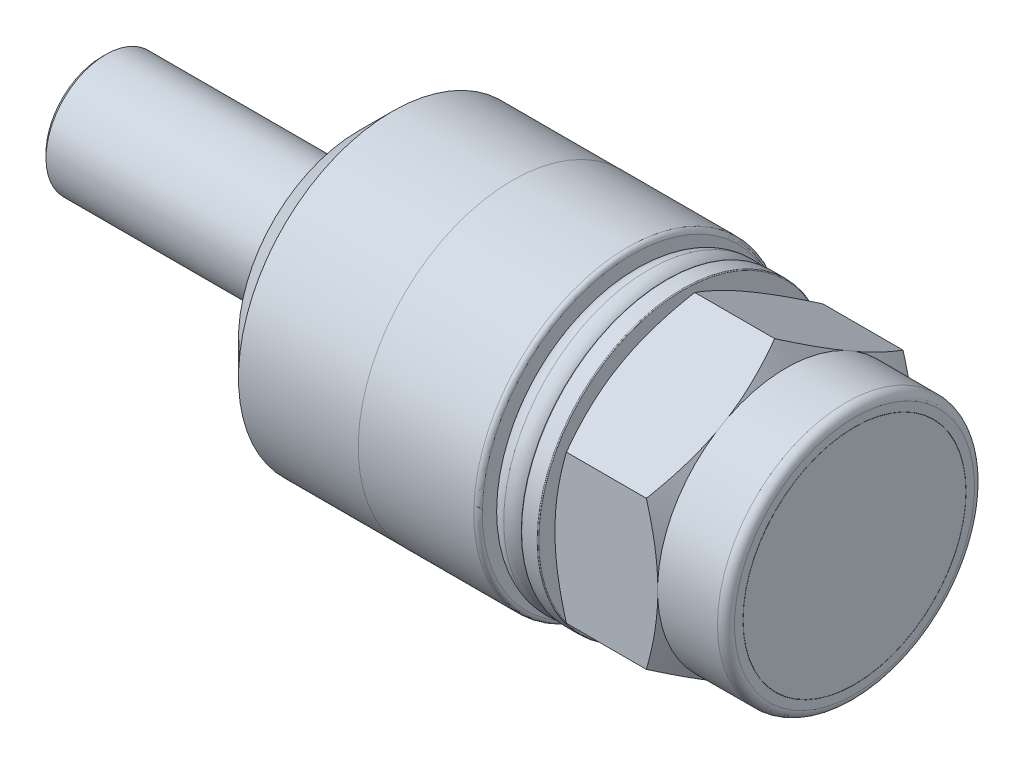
from build123d import *

# Parameters (mm, degrees)
BOSS_EXTRUDE1_DEPTH = 6


with BuildPart() as part:
    # Sketch1 → Revolve1 (revolve)
    with BuildSketch(Plane.XY):
        with BuildLine():
            Line((-31, 2.5), (-31, 3.25))
            Line((-31, 3.25), (-30.75, 3.5))
            Line((-30.75, 3.5), (-16.25, 3.5))
            Line((-16.25, 3.5), (-16, 3.25))
            Line((-16, 3.25), (-16, 3.5))
            Line((-16, 3.5), (-16, 7))
            Line((-16, 7), (-14.005, 8.995))
            Line((-14.005, 8.995), (-14, 8.995))
            Line((-14, 8.995), (-7, 8.995))
            Line((-7, 8.995), (-7, 9))
            Line((-7, 9), (-0.25, 9))
            ThreePointArc((-0.25, 9), (-0.073223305, 8.926776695), (0, 8.75))
            Line((0, 8.75), (0, 7.501))
            ThreePointArc((0, 7.501), (0.292600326, 8.207399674), (0.999, 8.5))
            Line((0.999, 8.5), (1.001, 8.5))
            ThreePointArc((1.001, 8.5), (1.707399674, 8.207399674), (2, 7.501))
            Line((2, 7.501), (2, 8.45))
            ThreePointArc((2, 8.45), (2.014644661, 8.485355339), (2.05, 8.5))
            Line((2.05, 8.5), (2.95, 8.5))
            ThreePointArc((2.95, 8.5), (2.985355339, 8.485355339), (3, 8.45))
            Line((3, 8.45), (3, 0))
            Line((3, 0), (-30.9, 0))
            Line((-30.9, 0), (-30.9, 2.5))
            Line((-30.9, 2.5), (-31, 2.5))
        make_face()
    revolve(axis=Axis((-30.9, 0, 0), (-1, 0, 0)))

    # Sketch2 → Boss-Extrude1 (add)
    with BuildSketch(Plane(origin=(3, 0, 0), x_dir=(0, 0, -1), z_dir=(1, 0, 0))):
        Polygon((0, 8.660254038), (-7.5, 4.330127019), (-7.5, -4.330127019), (0, -8.660254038), (7.5, -4.330127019), (7.5, 4.330127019), align=None)
    extrude(amount=BOSS_EXTRUDE1_DEPTH)

    # Sketch3 → Cut-Revolve1 (revolve, cut)
    with BuildSketch(Plane.XY):
        Polygon((3, 8.760254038), (3.721687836, 8.760254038), (3, 7.510254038), align=None)
        Polygon((9, 7.510254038), (9, 8.760254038), (8.278312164, 8.760254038), align=None)
    revolve(axis=Axis((6, 0, 0), (1, 0, 0)), mode=Mode.SUBTRACT)

    # Sketch4 → Revolve2 (revolve)
    with BuildSketch(Plane.XY, mode=Mode.PRIVATE) as revolve2_sk:
        with BuildLine():
            Line((9, 7.510254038), (9, 0))
            Line((9, 0), (13, 0))
            Line((13, 0), (13, 6.510254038))
            Line((13, 6.510254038), (12.9, 6.510254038))
            Line((12.9, 6.510254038), (12.9, 6.520254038))
            Line((12.9, 6.520254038), (13, 6.520254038))
            Line((13, 6.520254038), (13, 7.010254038))
            ThreePointArc((13, 7.010254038), (12.853553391, 7.363807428), (12.5, 7.510254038))
            Line((12.5, 7.510254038), (9, 7.510254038))
        make_face()
    revolve(revolve2_sk.sketch.rotate(Axis((9, 0, 0), (1, 0, 0)), 180), axis=Axis((9, 0, 0), (1, 0, 0)))


solid = part.part
